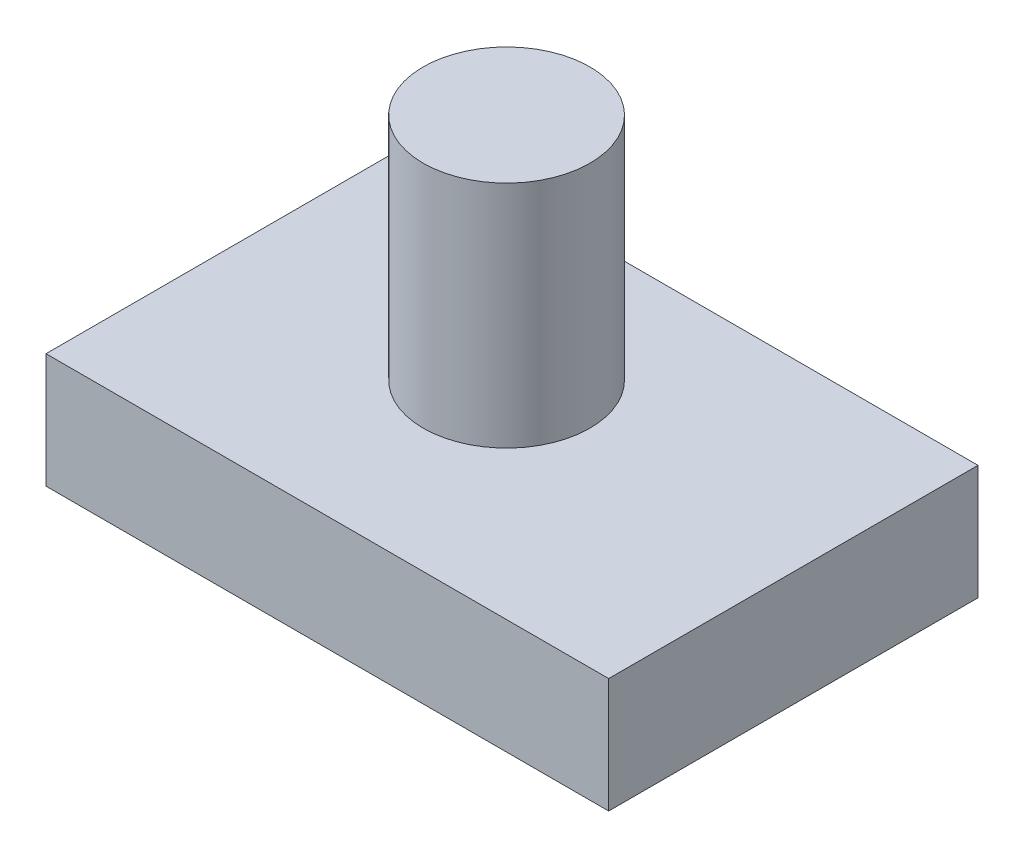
ISO-10303-21;
HEADER;
FILE_DESCRIPTION(('STEP AP214'),'2;1');
FILE_NAME('part.step','',(''),(''),'','','');
FILE_SCHEMA(('AUTOMOTIVE_DESIGN { 1 0 10303 214 1 1 1 1 }'));
ENDSEC;
DATA;
#1=APPLICATION_CONTEXT('core data for automotive mechanical design processes');
#2=APPLICATION_PROTOCOL_DEFINITION('international standard','automotive_design',2000,#1);
#3=PRODUCT_CONTEXT('',#1,'mechanical');
#4=PRODUCT('Part','Part','',(#3));
#5=PRODUCT_RELATED_PRODUCT_CATEGORY('part','',(#4));
#6=PRODUCT_DEFINITION_FORMATION('','',#4);
#7=PRODUCT_DEFINITION_CONTEXT('part definition',#1,'design');
#8=PRODUCT_DEFINITION('design','',#6,#7);
#9=PRODUCT_DEFINITION_SHAPE('','',#8);
#10=(LENGTH_UNIT() NAMED_UNIT(*) SI_UNIT(.MILLI.,.METRE.));
#11=(NAMED_UNIT(*) PLANE_ANGLE_UNIT() SI_UNIT($,.RADIAN.));
#12=(NAMED_UNIT(*) SI_UNIT($,.STERADIAN.) SOLID_ANGLE_UNIT());
#13=UNCERTAINTY_MEASURE_WITH_UNIT(LENGTH_MEASURE(1.E-05),#10,'distance_accuracy_value','');
#14=(GEOMETRIC_REPRESENTATION_CONTEXT(3) GLOBAL_UNCERTAINTY_ASSIGNED_CONTEXT((#13)) GLOBAL_UNIT_ASSIGNED_CONTEXT((#10,
#11,#12)) REPRESENTATION_CONTEXT('',''));
#15=CARTESIAN_POINT('',(0.,0.,0.));
#16=DIRECTION('',(0.,0.,1.));
#17=DIRECTION('',(1.,0.,0.));
#18=AXIS2_PLACEMENT_3D('',#15,#16,#17);
#19=CARTESIAN_POINT('',(-56.0242685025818,25.4,45.9254733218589));
#20=DIRECTION('',(0.,1.,0.));
#21=DIRECTION('',(0.,0.,1.));
#22=AXIS2_PLACEMENT_3D('',#19,#20,#21);
#23=PLANE('',#22);
#24=DIRECTION('',(0.,0.,1.));
#25=VECTOR('',#24,1.);
#26=CARTESIAN_POINT('',(-56.0242685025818,25.4,-35.826678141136));
#27=LINE('',#26,#25);
#28=CARTESIAN_POINT('',(-56.0242685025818,25.4,-35.826678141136));
#29=VERTEX_POINT('',#28);
#30=CARTESIAN_POINT('',(-56.0242685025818,25.4,45.9254733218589));
#31=VERTEX_POINT('',#30);
#32=EDGE_CURVE('E99',#29,#31,#27,.T.);
#33=ORIENTED_EDGE('',*,*,#32,.T.);
#34=DIRECTION('',(1.,0.,0.));
#35=VECTOR('',#34,1.);
#36=CARTESIAN_POINT('',(-56.0242685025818,25.4,45.9254733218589));
#37=LINE('',#36,#35);
#38=CARTESIAN_POINT('',(68.5275387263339,25.4,45.9254733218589));
#39=VERTEX_POINT('',#38);
#40=EDGE_CURVE('E84',#31,#39,#37,.T.);
#41=ORIENTED_EDGE('',*,*,#40,.T.);
#42=DIRECTION('',(0.,0.,-1.));
#43=VECTOR('',#42,1.);
#44=CARTESIAN_POINT('',(68.5275387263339,25.4,-35.826678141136));
#45=LINE('',#44,#43);
#46=CARTESIAN_POINT('',(68.5275387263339,25.4,-35.826678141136));
#47=VERTEX_POINT('',#46);
#48=EDGE_CURVE('E51',#39,#47,#45,.T.);
#49=ORIENTED_EDGE('',*,*,#48,.T.);
#50=DIRECTION('',(-1.,0.,0.));
#51=VECTOR('',#50,1.);
#52=CARTESIAN_POINT('',(-56.0242685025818,25.4,-35.826678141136));
#53=LINE('',#52,#51);
#54=EDGE_CURVE('E46',#47,#29,#53,.T.);
#55=ORIENTED_EDGE('',*,*,#54,.T.);
#56=EDGE_LOOP('',(#33,#41,#49,#55));
#57=FACE_BOUND('',#56,.T.);
#58=CARTESIAN_POINT('',(0.,25.4,0.));
#59=DIRECTION('',(0.,1.,0.));
#60=DIRECTION('',(0.,0.,1.));
#61=AXIS2_PLACEMENT_3D('',#58,#59,#60);
#62=CIRCLE('',#61,18.4625705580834);
#63=CARTESIAN_POINT('',(0.,25.4,18.4625705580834));
#64=VERTEX_POINT('',#63);
#65=EDGE_CURVE('E92',#64,#64,#62,.T.);
#66=ORIENTED_EDGE('',*,*,#65,.F.);
#67=EDGE_LOOP('',(#66));
#68=FACE_BOUND('',#67,.T.);
#69=ADVANCED_FACE('F31',(#57,#68),#23,.T.);
#70=CARTESIAN_POINT('',(-56.0242685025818,25.4,-35.826678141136));
#71=DIRECTION('',(1.,0.,0.));
#72=DIRECTION('',(0.,0.,-1.));
#73=AXIS2_PLACEMENT_3D('',#70,#71,#72);
#74=PLANE('',#73);
#75=DIRECTION('',(0.,0.,1.));
#76=VECTOR('',#75,1.);
#77=CARTESIAN_POINT('',(-56.0242685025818,0.,-35.826678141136));
#78=LINE('',#77,#76);
#79=CARTESIAN_POINT('',(-56.0242685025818,0.,-35.826678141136));
#80=VERTEX_POINT('',#79);
#81=CARTESIAN_POINT('',(-56.0242685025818,0.,45.9254733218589));
#82=VERTEX_POINT('',#81);
#83=EDGE_CURVE('E76',#80,#82,#78,.T.);
#84=ORIENTED_EDGE('',*,*,#83,.T.);
#85=DIRECTION('',(0.,-1.,0.));
#86=VECTOR('',#85,1.);
#87=CARTESIAN_POINT('',(-56.0242685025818,25.4,45.9254733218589));
#88=LINE('',#87,#86);
#89=EDGE_CURVE('E11',#31,#82,#88,.T.);
#90=ORIENTED_EDGE('',*,*,#89,.F.);
#91=ORIENTED_EDGE('',*,*,#32,.F.);
#92=DIRECTION('',(0.,-1.,0.));
#93=VECTOR('',#92,1.);
#94=CARTESIAN_POINT('',(-56.0242685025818,25.4,-35.826678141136));
#95=LINE('',#94,#93);
#96=EDGE_CURVE('E88',#29,#80,#95,.T.);
#97=ORIENTED_EDGE('',*,*,#96,.T.);
#98=EDGE_LOOP('',(#84,#90,#91,#97));
#99=FACE_BOUND('',#98,.T.);
#100=ADVANCED_FACE('F33',(#99),#74,.F.);
#101=CARTESIAN_POINT('',(-56.0242685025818,25.4,45.9254733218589));
#102=DIRECTION('',(0.,0.,-1.));
#103=DIRECTION('',(-1.,0.,0.));
#104=AXIS2_PLACEMENT_3D('',#101,#102,#103);
#105=PLANE('',#104);
#106=DIRECTION('',(1.,0.,0.));
#107=VECTOR('',#106,1.);
#108=CARTESIAN_POINT('',(-56.0242685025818,0.,45.9254733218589));
#109=LINE('',#108,#107);
#110=CARTESIAN_POINT('',(68.5275387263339,0.,45.9254733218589));
#111=VERTEX_POINT('',#110);
#112=EDGE_CURVE('E72',#82,#111,#109,.T.);
#113=ORIENTED_EDGE('',*,*,#112,.T.);
#114=DIRECTION('',(0.,-1.,0.));
#115=VECTOR('',#114,1.);
#116=CARTESIAN_POINT('',(68.5275387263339,25.4,45.9254733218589));
#117=LINE('',#116,#115);
#118=EDGE_CURVE('E39',#39,#111,#117,.T.);
#119=ORIENTED_EDGE('',*,*,#118,.F.);
#120=ORIENTED_EDGE('',*,*,#40,.F.);
#121=ORIENTED_EDGE('',*,*,#89,.T.);
#122=EDGE_LOOP('',(#113,#119,#120,#121));
#123=FACE_BOUND('',#122,.T.);
#124=ADVANCED_FACE('F83',(#123),#105,.F.);
#125=CARTESIAN_POINT('',(68.5275387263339,25.4,-35.826678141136));
#126=DIRECTION('',(-1.,0.,0.));
#127=DIRECTION('',(0.,0.,1.));
#128=AXIS2_PLACEMENT_3D('',#125,#126,#127);
#129=PLANE('',#128);
#130=DIRECTION('',(0.,0.,-1.));
#131=VECTOR('',#130,1.);
#132=CARTESIAN_POINT('',(68.5275387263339,0.,-35.826678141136));
#133=LINE('',#132,#131);
#134=CARTESIAN_POINT('',(68.5275387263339,0.,-35.826678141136));
#135=VERTEX_POINT('',#134);
#136=EDGE_CURVE('E77',#111,#135,#133,.T.);
#137=ORIENTED_EDGE('',*,*,#136,.T.);
#138=DIRECTION('',(0.,-1.,0.));
#139=VECTOR('',#138,1.);
#140=CARTESIAN_POINT('',(68.5275387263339,25.4,-35.826678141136));
#141=LINE('',#140,#139);
#142=EDGE_CURVE('E105',#47,#135,#141,.T.);
#143=ORIENTED_EDGE('',*,*,#142,.F.);
#144=ORIENTED_EDGE('',*,*,#48,.F.);
#145=ORIENTED_EDGE('',*,*,#118,.T.);
#146=EDGE_LOOP('',(#137,#143,#144,#145));
#147=FACE_BOUND('',#146,.T.);
#148=ADVANCED_FACE('F108',(#147),#129,.F.);
#149=CARTESIAN_POINT('',(-56.0242685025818,25.4,-35.826678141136));
#150=DIRECTION('',(0.,0.,1.));
#151=DIRECTION('',(1.,0.,0.));
#152=AXIS2_PLACEMENT_3D('',#149,#150,#151);
#153=PLANE('',#152);
#154=DIRECTION('',(-1.,0.,0.));
#155=VECTOR('',#154,1.);
#156=CARTESIAN_POINT('',(-56.0242685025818,0.,-35.826678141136));
#157=LINE('',#156,#155);
#158=EDGE_CURVE('E97',#135,#80,#157,.T.);
#159=ORIENTED_EDGE('',*,*,#158,.T.);
#160=ORIENTED_EDGE('',*,*,#96,.F.);
#161=ORIENTED_EDGE('',*,*,#54,.F.);
#162=ORIENTED_EDGE('',*,*,#142,.T.);
#163=EDGE_LOOP('',(#159,#160,#161,#162));
#164=FACE_BOUND('',#163,.T.);
#165=ADVANCED_FACE('F110',(#164),#153,.F.);
#166=CARTESIAN_POINT('',(-56.0242685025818,0.,45.9254733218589));
#167=DIRECTION('',(0.,1.,0.));
#168=DIRECTION('',(0.,0.,1.));
#169=AXIS2_PLACEMENT_3D('',#166,#167,#168);
#170=PLANE('',#169);
#171=ORIENTED_EDGE('',*,*,#83,.F.);
#172=ORIENTED_EDGE('',*,*,#158,.F.);
#173=ORIENTED_EDGE('',*,*,#136,.F.);
#174=ORIENTED_EDGE('',*,*,#112,.F.);
#175=EDGE_LOOP('',(#171,#172,#173,#174));
#176=FACE_BOUND('',#175,.T.);
#177=ADVANCED_FACE('F73',(#176),#170,.F.);
#178=CARTESIAN_POINT('',(0.,76.2,0.));
#179=DIRECTION('',(0.,-1.,0.));
#180=DIRECTION('',(0.,0.,-1.));
#181=AXIS2_PLACEMENT_3D('',#178,#179,#180);
#182=CYLINDRICAL_SURFACE('',#181,18.4625705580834);
#183=CARTESIAN_POINT('',(0.,76.2,0.));
#184=DIRECTION('',(0.,1.,0.));
#185=DIRECTION('',(0.,0.,1.));
#186=AXIS2_PLACEMENT_3D('',#183,#184,#185);
#187=CIRCLE('',#186,18.4625705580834);
#188=CARTESIAN_POINT('',(0.,76.2,18.4625705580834));
#189=VERTEX_POINT('',#188);
#190=EDGE_CURVE('E89',#189,#189,#187,.T.);
#191=ORIENTED_EDGE('',*,*,#190,.F.);
#192=EDGE_LOOP('',(#191));
#193=FACE_BOUND('',#192,.T.);
#194=ORIENTED_EDGE('',*,*,#65,.T.);
#195=EDGE_LOOP('',(#194));
#196=FACE_BOUND('',#195,.T.);
#197=ADVANCED_FACE('F117',(#193,#196),#182,.T.);
#198=CARTESIAN_POINT('',(0.,76.2,0.));
#199=DIRECTION('',(0.,1.,0.));
#200=DIRECTION('',(0.,0.,1.));
#201=AXIS2_PLACEMENT_3D('',#198,#199,#200);
#202=PLANE('',#201);
#203=ORIENTED_EDGE('',*,*,#190,.T.);
#204=EDGE_LOOP('',(#203));
#205=FACE_BOUND('',#204,.T.);
#206=ADVANCED_FACE('F119',(#205),#202,.T.);
#207=CLOSED_SHELL('',(#69,#100,#124,#148,#165,#177,#197,#206));
#208=MANIFOLD_SOLID_BREP('B2',#207);
#209=ADVANCED_BREP_SHAPE_REPRESENTATION('',(#18,#208),#14);
#210=SHAPE_DEFINITION_REPRESENTATION(#9,#209);
ENDSEC;
END-ISO-10303-21;
